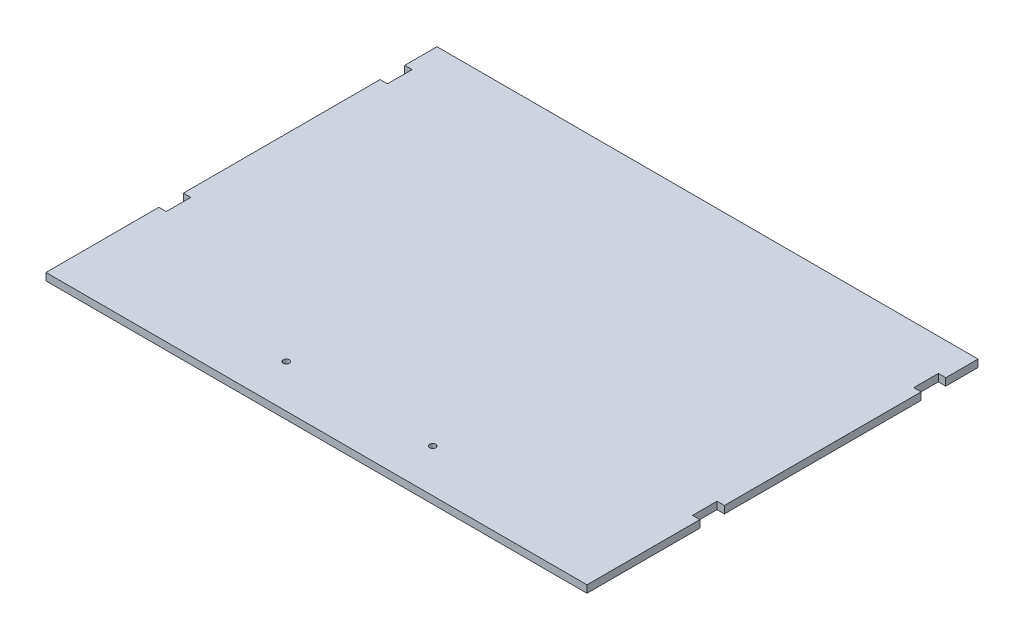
from build123d import *

# Parameters (mm, degrees)
SKIZZE1_R                       = 2.5
AUFSATZ_LINEAR_AUSTRAGEN1_DEPTH = 6


with BuildPart() as part:
    # Skizze1 → Aufsatz-Linear austragen1 (new body)
    with BuildSketch(Plane(origin=(0, 0, 0), x_dir=(1, 0, 0), z_dir=(0, 1, 0))):
        Polygon((-220, 112.75), (-220, -47.25), (-214, -47.25), (-214, -67.25), (-220, -67.25), (-220, -159), (220, -159), (220, -67.25), (214, -67.25), (214, -47.25), (220, -47.25), (220, 112.75), (214, 112.75), (214, 132.75), (220, 132.75), (220, 159), (-220, 159), (-220, 132.75), (-214, 132.75), (-214, 112.75), align=None)
        with Locations(Location((-59.5, -124, 0), (0, 0, 270))):
            Circle(SKIZZE1_R, mode=Mode.SUBTRACT)
        with Locations(Location((59.5, -124, 0), (0, 0, 90))):
            Circle(SKIZZE1_R, mode=Mode.SUBTRACT)
    extrude(amount=AUFSATZ_LINEAR_AUSTRAGEN1_DEPTH)


solid = part.part
